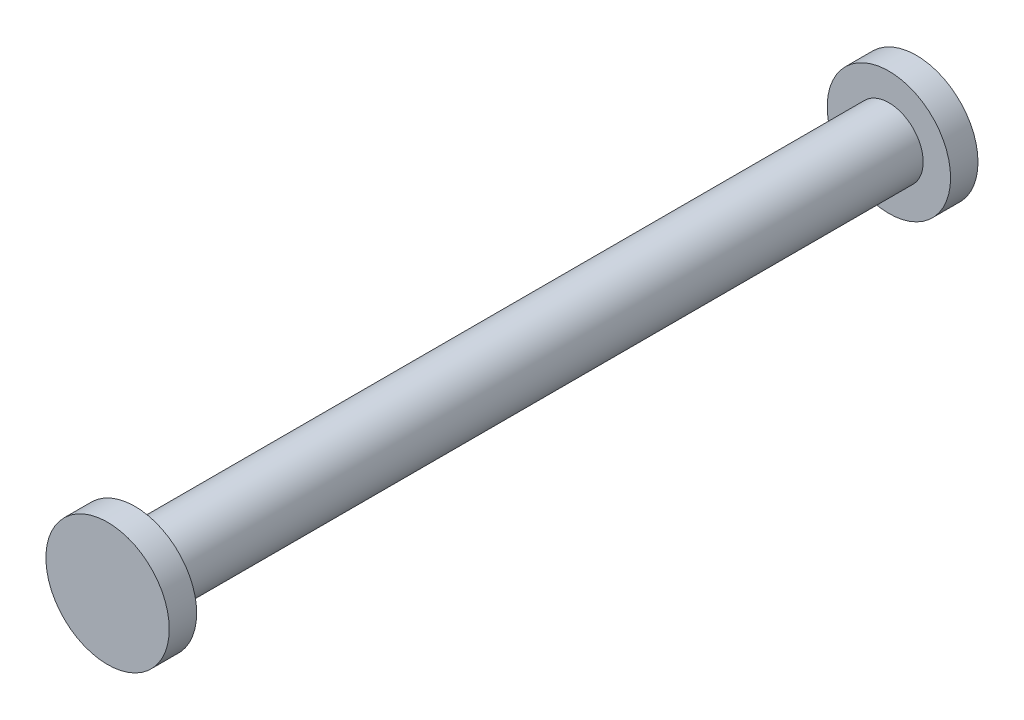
ISO-10303-21;
HEADER;
FILE_DESCRIPTION(('STEP AP214'),'2;1');
FILE_NAME('part.step','',(''),(''),'','','');
FILE_SCHEMA(('AUTOMOTIVE_DESIGN { 1 0 10303 214 1 1 1 1 }'));
ENDSEC;
DATA;
#1=APPLICATION_CONTEXT('core data for automotive mechanical design processes');
#2=APPLICATION_PROTOCOL_DEFINITION('international standard','automotive_design',2000,#1);
#3=PRODUCT_CONTEXT('',#1,'mechanical');
#4=PRODUCT('Part','Part','',(#3));
#5=PRODUCT_RELATED_PRODUCT_CATEGORY('part','',(#4));
#6=PRODUCT_DEFINITION_FORMATION('','',#4);
#7=PRODUCT_DEFINITION_CONTEXT('part definition',#1,'design');
#8=PRODUCT_DEFINITION('design','',#6,#7);
#9=PRODUCT_DEFINITION_SHAPE('','',#8);
#10=(LENGTH_UNIT() NAMED_UNIT(*) SI_UNIT(.MILLI.,.METRE.));
#11=(NAMED_UNIT(*) PLANE_ANGLE_UNIT() SI_UNIT($,.RADIAN.));
#12=(NAMED_UNIT(*) SI_UNIT($,.STERADIAN.) SOLID_ANGLE_UNIT());
#13=UNCERTAINTY_MEASURE_WITH_UNIT(LENGTH_MEASURE(1.E-05),#10,'distance_accuracy_value','');
#14=(GEOMETRIC_REPRESENTATION_CONTEXT(3) GLOBAL_UNCERTAINTY_ASSIGNED_CONTEXT((#13)) GLOBAL_UNIT_ASSIGNED_CONTEXT((#10,
#11,#12)) REPRESENTATION_CONTEXT('',''));
#15=CARTESIAN_POINT('',(0.,0.,0.));
#16=DIRECTION('',(0.,0.,1.));
#17=DIRECTION('',(1.,0.,0.));
#18=AXIS2_PLACEMENT_3D('',#15,#16,#17);
#19=CARTESIAN_POINT('',(0.,0.,-29.5));
#20=DIRECTION('',(0.,0.,1.));
#21=DIRECTION('',(1.,0.,0.));
#22=AXIS2_PLACEMENT_3D('',#19,#20,#21);
#23=CYLINDRICAL_SURFACE('',#22,4.5);
#24=CARTESIAN_POINT('',(0.,0.,-29.5));
#25=DIRECTION('',(0.,0.,1.));
#26=DIRECTION('',(1.,0.,0.));
#27=AXIS2_PLACEMENT_3D('',#24,#25,#26);
#28=CIRCLE('',#27,4.5);
#29=CARTESIAN_POINT('',(4.5,0.,-29.5));
#30=VERTEX_POINT('',#29);
#31=EDGE_CURVE('E10',#30,#30,#28,.T.);
#32=ORIENTED_EDGE('',*,*,#31,.T.);
#33=EDGE_LOOP('',(#32));
#34=FACE_BOUND('',#33,.T.);
#35=CARTESIAN_POINT('',(0.,0.,-27.5));
#36=DIRECTION('',(0.,0.,1.));
#37=DIRECTION('',(1.,0.,0.));
#38=AXIS2_PLACEMENT_3D('',#35,#36,#37);
#39=CIRCLE('',#38,4.5);
#40=CARTESIAN_POINT('',(4.5,0.,-27.5));
#41=VERTEX_POINT('',#40);
#42=EDGE_CURVE('E43',#41,#41,#39,.F.);
#43=ORIENTED_EDGE('',*,*,#42,.T.);
#44=EDGE_LOOP('',(#43));
#45=FACE_BOUND('',#44,.T.);
#46=ADVANCED_FACE('F39',(#34,#45),#23,.T.);
#47=CARTESIAN_POINT('',(0.,0.,-29.5));
#48=DIRECTION('',(0.,0.,1.));
#49=DIRECTION('',(1.,0.,0.));
#50=AXIS2_PLACEMENT_3D('',#47,#48,#49);
#51=PLANE('',#50);
#52=ORIENTED_EDGE('',*,*,#31,.F.);
#53=EDGE_LOOP('',(#52));
#54=FACE_BOUND('',#53,.T.);
#55=ADVANCED_FACE('F84',(#54),#51,.F.);
#56=CARTESIAN_POINT('',(0.,0.,-27.5));
#57=DIRECTION('',(0.,0.,1.));
#58=DIRECTION('',(1.,0.,0.));
#59=AXIS2_PLACEMENT_3D('',#56,#57,#58);
#60=PLANE('',#59);
#61=ORIENTED_EDGE('',*,*,#42,.F.);
#62=EDGE_LOOP('',(#61));
#63=FACE_BOUND('',#62,.T.);
#64=CARTESIAN_POINT('',(0.,0.,-27.5));
#65=DIRECTION('',(0.,0.,1.));
#66=DIRECTION('',(1.,0.,0.));
#67=AXIS2_PLACEMENT_3D('',#64,#65,#66);
#68=CIRCLE('',#67,2.5);
#69=CARTESIAN_POINT('',(2.5,0.,-27.5));
#70=VERTEX_POINT('',#69);
#71=EDGE_CURVE('E58',#70,#70,#68,.T.);
#72=ORIENTED_EDGE('',*,*,#71,.F.);
#73=EDGE_LOOP('',(#72));
#74=FACE_BOUND('',#73,.T.);
#75=ADVANCED_FACE('F80',(#63,#74),#60,.T.);
#76=CARTESIAN_POINT('',(0.,0.,27.5));
#77=DIRECTION('',(0.,0.,1.));
#78=DIRECTION('',(1.,0.,0.));
#79=AXIS2_PLACEMENT_3D('',#76,#77,#78);
#80=PLANE('',#79);
#81=CARTESIAN_POINT('',(0.,0.,27.5));
#82=DIRECTION('',(0.,0.,1.));
#83=DIRECTION('',(1.,0.,0.));
#84=AXIS2_PLACEMENT_3D('',#81,#82,#83);
#85=CIRCLE('',#84,4.5);
#86=CARTESIAN_POINT('',(4.5,0.,27.5));
#87=VERTEX_POINT('',#86);
#88=EDGE_CURVE('E56',#87,#87,#85,.F.);
#89=ORIENTED_EDGE('',*,*,#88,.T.);
#90=EDGE_LOOP('',(#89));
#91=FACE_BOUND('',#90,.T.);
#92=CARTESIAN_POINT('',(0.,0.,27.5));
#93=DIRECTION('',(0.,0.,1.));
#94=DIRECTION('',(1.,0.,0.));
#95=AXIS2_PLACEMENT_3D('',#92,#93,#94);
#96=CIRCLE('',#95,2.5);
#97=CARTESIAN_POINT('',(2.5,0.,27.5));
#98=VERTEX_POINT('',#97);
#99=EDGE_CURVE('E54',#98,#98,#96,.T.);
#100=ORIENTED_EDGE('',*,*,#99,.T.);
#101=EDGE_LOOP('',(#100));
#102=FACE_BOUND('',#101,.T.);
#103=ADVANCED_FACE('F68',(#91,#102),#80,.F.);
#104=CARTESIAN_POINT('',(0.,0.,-27.5));
#105=DIRECTION('',(0.,0.,1.));
#106=DIRECTION('',(1.,0.,0.));
#107=AXIS2_PLACEMENT_3D('',#104,#105,#106);
#108=CYLINDRICAL_SURFACE('',#107,2.5);
#109=ORIENTED_EDGE('',*,*,#71,.T.);
#110=EDGE_LOOP('',(#109));
#111=FACE_BOUND('',#110,.T.);
#112=ORIENTED_EDGE('',*,*,#99,.F.);
#113=EDGE_LOOP('',(#112));
#114=FACE_BOUND('',#113,.T.);
#115=ADVANCED_FACE('F70',(#111,#114),#108,.T.);
#116=CARTESIAN_POINT('',(0.,0.,29.5));
#117=DIRECTION('',(0.,0.,1.));
#118=DIRECTION('',(1.,0.,0.));
#119=AXIS2_PLACEMENT_3D('',#116,#117,#118);
#120=PLANE('',#119);
#121=CARTESIAN_POINT('',(0.,0.,29.5));
#122=DIRECTION('',(0.,0.,1.));
#123=DIRECTION('',(1.,0.,0.));
#124=AXIS2_PLACEMENT_3D('',#121,#122,#123);
#125=CIRCLE('',#124,4.5);
#126=CARTESIAN_POINT('',(4.5,0.,29.5));
#127=VERTEX_POINT('',#126);
#128=EDGE_CURVE('E47',#127,#127,#125,.T.);
#129=ORIENTED_EDGE('',*,*,#128,.T.);
#130=EDGE_LOOP('',(#129));
#131=FACE_BOUND('',#130,.T.);
#132=ADVANCED_FACE('F72',(#131),#120,.T.);
#133=ORIENTED_EDGE('',*,*,#88,.F.);
#134=EDGE_LOOP('',(#133));
#135=FACE_BOUND('',#134,.T.);
#136=ORIENTED_EDGE('',*,*,#128,.F.);
#137=EDGE_LOOP('',(#136));
#138=FACE_BOUND('',#137,.T.);
#139=ADVANCED_FACE('F41',(#135,#138),#23,.T.);
#140=CLOSED_SHELL('',(#46,#55,#75,#103,#115,#132,#139));
#141=MANIFOLD_SOLID_BREP('B2',#140);
#142=ADVANCED_BREP_SHAPE_REPRESENTATION('',(#18,#141),#14);
#143=SHAPE_DEFINITION_REPRESENTATION(#9,#142);
ENDSEC;
END-ISO-10303-21;
